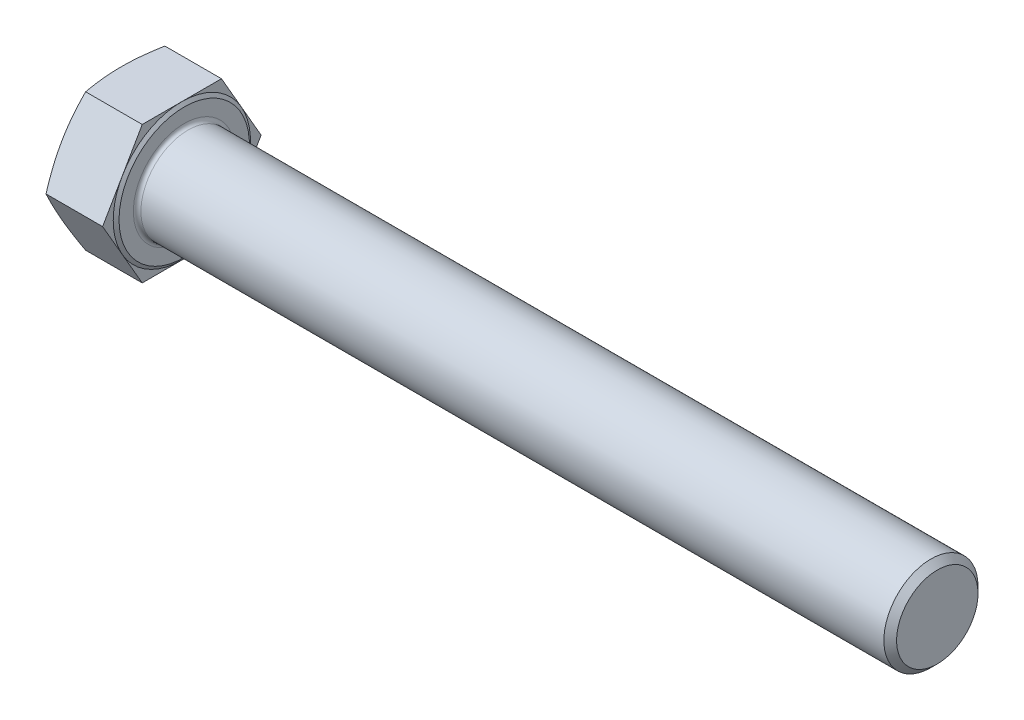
ISO-10303-21;
HEADER;
FILE_DESCRIPTION(('STEP AP214'),'2;1');
FILE_NAME('part.step','',(''),(''),'','','');
FILE_SCHEMA(('AUTOMOTIVE_DESIGN { 1 0 10303 214 1 1 1 1 }'));
ENDSEC;
DATA;
#1=APPLICATION_CONTEXT('core data for automotive mechanical design processes');
#2=APPLICATION_PROTOCOL_DEFINITION('international standard','automotive_design',2000,#1);
#3=PRODUCT_CONTEXT('',#1,'mechanical');
#4=PRODUCT('Part','Part','',(#3));
#5=PRODUCT_RELATED_PRODUCT_CATEGORY('part','',(#4));
#6=PRODUCT_DEFINITION_FORMATION('','',#4);
#7=PRODUCT_DEFINITION_CONTEXT('part definition',#1,'design');
#8=PRODUCT_DEFINITION('design','',#6,#7);
#9=PRODUCT_DEFINITION_SHAPE('','',#8);
#10=(LENGTH_UNIT() NAMED_UNIT(*) SI_UNIT(.MILLI.,.METRE.));
#11=(NAMED_UNIT(*) PLANE_ANGLE_UNIT() SI_UNIT($,.RADIAN.));
#12=(NAMED_UNIT(*) SI_UNIT($,.STERADIAN.) SOLID_ANGLE_UNIT());
#13=UNCERTAINTY_MEASURE_WITH_UNIT(LENGTH_MEASURE(1.E-05),#10,'distance_accuracy_value','');
#14=(GEOMETRIC_REPRESENTATION_CONTEXT(3) GLOBAL_UNCERTAINTY_ASSIGNED_CONTEXT((#13)) GLOBAL_UNIT_ASSIGNED_CONTEXT((#10,
#11,#12)) REPRESENTATION_CONTEXT('',''));
#15=CARTESIAN_POINT('',(0.,0.,0.));
#16=DIRECTION('',(0.,0.,1.));
#17=DIRECTION('',(1.,0.,0.));
#18=AXIS2_PLACEMENT_3D('',#15,#16,#17);
#19=CARTESIAN_POINT('',(13.35,0.,0.));
#20=DIRECTION('',(1.,0.,0.));
#21=DIRECTION('',(0.,0.,-1.));
#22=AXIS2_PLACEMENT_3D('',#19,#20,#21);
#23=PLANE('',#22);
#24=CARTESIAN_POINT('',(13.35,0.,0.));
#25=DIRECTION('',(1.,0.,0.));
#26=DIRECTION('',(0.,0.,-1.));
#27=AXIS2_PLACEMENT_3D('',#24,#25,#26);
#28=CIRCLE('',#27,10.8);
#29=CARTESIAN_POINT('',(13.35,0.,-10.8));
#30=VERTEX_POINT('',#29);
#31=EDGE_CURVE('E188',#30,#30,#28,.F.);
#32=ORIENTED_EDGE('',*,*,#31,.T.);
#33=EDGE_LOOP('',(#32));
#34=FACE_BOUND('',#33,.T.);
#35=CARTESIAN_POINT('',(13.35,0.,0.));
#36=DIRECTION('',(-1.,0.,0.));
#37=DIRECTION('',(0.,0.,1.));
#38=AXIS2_PLACEMENT_3D('',#35,#36,#37);
#39=CIRCLE('',#38,13.85);
#40=CARTESIAN_POINT('',(13.35,0.,13.85));
#41=VERTEX_POINT('',#40);
#42=EDGE_CURVE('E139',#41,#41,#39,.T.);
#43=ORIENTED_EDGE('',*,*,#42,.F.);
#44=EDGE_LOOP('',(#43));
#45=FACE_BOUND('',#44,.T.);
#46=ADVANCED_FACE('F33',(#34,#45),#23,.T.);
#47=CARTESIAN_POINT('',(12.85,0.,-16.8355338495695));
#48=DIRECTION('',(1.,0.,0.));
#49=DIRECTION('',(0.,0.,-1.));
#50=AXIS2_PLACEMENT_3D('',#47,#48,#49);
#51=PLANE('',#50);
#52=DIRECTION('',(0.,-0.866025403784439,0.5));
#53=VECTOR('',#52,1.);
#54=CARTESIAN_POINT('',(12.85,14.58,8.41776692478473));
#55=LINE('',#54,#53);
#56=CARTESIAN_POINT('',(12.85,14.58,8.41776692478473));
#57=VERTEX_POINT('',#56);
#58=CARTESIAN_POINT('',(12.85,7.29,12.6266503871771));
#59=VERTEX_POINT('',#58);
#60=EDGE_CURVE('E138',#57,#59,#55,.T.);
#61=ORIENTED_EDGE('',*,*,#60,.T.);
#62=CARTESIAN_POINT('',(12.85,0.,0.));
#63=DIRECTION('',(-1.,0.,0.));
#64=DIRECTION('',(0.,0.,1.));
#65=AXIS2_PLACEMENT_3D('',#62,#63,#64);
#66=CIRCLE('',#65,14.58);
#67=CARTESIAN_POINT('',(12.85,14.58,0.));
#68=VERTEX_POINT('',#67);
#69=EDGE_CURVE('E49',#59,#68,#66,.T.);
#70=ORIENTED_EDGE('',*,*,#69,.T.);
#71=DIRECTION('',(0.,0.,1.));
#72=VECTOR('',#71,1.);
#73=CARTESIAN_POINT('',(12.85,14.58,-8.41776692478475));
#74=LINE('',#73,#72);
#75=EDGE_CURVE('E135',#68,#57,#74,.T.);
#76=ORIENTED_EDGE('',*,*,#75,.T.);
#77=EDGE_LOOP('',(#61,#70,#76));
#78=FACE_BOUND('',#77,.T.);
#79=ADVANCED_FACE('F134',(#78),#51,.T.);
#80=CARTESIAN_POINT('',(12.85,14.58,-8.41776692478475));
#81=VERTEX_POINT('',#80);
#82=EDGE_CURVE('E145',#81,#68,#74,.T.);
#83=ORIENTED_EDGE('',*,*,#82,.T.);
#84=CARTESIAN_POINT('',(12.85,7.29,-12.6266503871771));
#85=VERTEX_POINT('',#84);
#86=EDGE_CURVE('E122',#68,#85,#66,.T.);
#87=ORIENTED_EDGE('',*,*,#86,.T.);
#88=DIRECTION('',(0.,0.866025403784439,0.5));
#89=VECTOR('',#88,1.);
#90=CARTESIAN_POINT('',(12.85,0.,-16.8355338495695));
#91=LINE('',#90,#89);
#92=EDGE_CURVE('E151',#85,#81,#91,.T.);
#93=ORIENTED_EDGE('',*,*,#92,.T.);
#94=EDGE_LOOP('',(#83,#87,#93));
#95=FACE_BOUND('',#94,.T.);
#96=ADVANCED_FACE('F150',(#95),#51,.T.);
#97=CARTESIAN_POINT('',(12.85,0.,-16.8355338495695));
#98=VERTEX_POINT('',#97);
#99=EDGE_CURVE('E148',#98,#85,#91,.T.);
#100=ORIENTED_EDGE('',*,*,#99,.T.);
#101=CARTESIAN_POINT('',(12.85,-7.29,-12.6266503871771));
#102=VERTEX_POINT('',#101);
#103=EDGE_CURVE('E125',#85,#102,#66,.T.);
#104=ORIENTED_EDGE('',*,*,#103,.T.);
#105=DIRECTION('',(0.,0.866025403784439,-0.5));
#106=VECTOR('',#105,1.);
#107=CARTESIAN_POINT('',(12.85,-14.58,-8.41776692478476));
#108=LINE('',#107,#106);
#109=EDGE_CURVE('E306',#102,#98,#108,.T.);
#110=ORIENTED_EDGE('',*,*,#109,.T.);
#111=EDGE_LOOP('',(#100,#104,#110));
#112=FACE_BOUND('',#111,.T.);
#113=ADVANCED_FACE('F337',(#112),#51,.T.);
#114=CARTESIAN_POINT('',(12.85,-14.58,-8.41776692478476));
#115=VERTEX_POINT('',#114);
#116=EDGE_CURVE('E304',#115,#102,#108,.T.);
#117=ORIENTED_EDGE('',*,*,#116,.T.);
#118=CARTESIAN_POINT('',(12.85,-14.58,0.));
#119=VERTEX_POINT('',#118);
#120=EDGE_CURVE('E338',#102,#119,#66,.T.);
#121=ORIENTED_EDGE('',*,*,#120,.T.);
#122=DIRECTION('',(0.,0.,-1.));
#123=VECTOR('',#122,1.);
#124=CARTESIAN_POINT('',(12.85,-14.58,8.41776692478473));
#125=LINE('',#124,#123);
#126=EDGE_CURVE('E162',#119,#115,#125,.T.);
#127=ORIENTED_EDGE('',*,*,#126,.T.);
#128=EDGE_LOOP('',(#117,#121,#127));
#129=FACE_BOUND('',#128,.T.);
#130=ADVANCED_FACE('F352',(#129),#51,.T.);
#131=CARTESIAN_POINT('',(12.85,-14.58,8.41776692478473));
#132=VERTEX_POINT('',#131);
#133=EDGE_CURVE('E163',#132,#119,#125,.T.);
#134=ORIENTED_EDGE('',*,*,#133,.T.);
#135=CARTESIAN_POINT('',(12.85,-7.29,12.6266503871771));
#136=VERTEX_POINT('',#135);
#137=EDGE_CURVE('E339',#119,#136,#66,.T.);
#138=ORIENTED_EDGE('',*,*,#137,.T.);
#139=DIRECTION('',(0.,-0.866025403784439,-0.5));
#140=VECTOR('',#139,1.);
#141=CARTESIAN_POINT('',(12.85,0.,16.8355338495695));
#142=LINE('',#141,#140);
#143=EDGE_CURVE('E158',#136,#132,#142,.T.);
#144=ORIENTED_EDGE('',*,*,#143,.T.);
#145=EDGE_LOOP('',(#134,#138,#144));
#146=FACE_BOUND('',#145,.T.);
#147=ADVANCED_FACE('F347',(#146),#51,.T.);
#148=CARTESIAN_POINT('',(12.85,0.,16.8355338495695));
#149=VERTEX_POINT('',#148);
#150=EDGE_CURVE('E159',#149,#136,#142,.T.);
#151=ORIENTED_EDGE('',*,*,#150,.T.);
#152=EDGE_CURVE('E140',#136,#59,#66,.T.);
#153=ORIENTED_EDGE('',*,*,#152,.T.);
#154=EDGE_CURVE('E153',#59,#149,#55,.T.);
#155=ORIENTED_EDGE('',*,*,#154,.T.);
#156=EDGE_LOOP('',(#151,#153,#155));
#157=FACE_BOUND('',#156,.T.);
#158=ADVANCED_FACE('F213',(#157),#51,.T.);
#159=CARTESIAN_POINT('',(12.85,-14.58,-8.41776692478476));
#160=DIRECTION('',(0.,0.5,0.866025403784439));
#161=DIRECTION('',(0.,-0.866025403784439,0.5));
#162=AXIS2_PLACEMENT_3D('',#159,#160,#161);
#163=PLANE('',#162);
#164=CARTESIAN_POINT('',(0.820989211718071,0.00020000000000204,-16.8356493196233));
#165=CARTESIAN_POINT('',(0.757543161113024,-0.301745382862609,-16.6613210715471));
#166=CARTESIAN_POINT('',(0.696950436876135,-0.604134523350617,-16.4867366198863));
#167=CARTESIAN_POINT('',(0.582099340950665,-1.20984152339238,-16.1370315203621));
#168=CARTESIAN_POINT('',(0.52784157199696,-1.51315946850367,-15.9619108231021));
#169=CARTESIAN_POINT('',(0.375459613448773,-2.42490202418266,-15.4355160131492));
#170=CARTESIAN_POINT('',(0.28781624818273,-3.03469793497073,-15.083450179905));
#171=CARTESIAN_POINT('',(0.181301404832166,-3.94862655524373,-14.5557932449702));
#172=CARTESIAN_POINT('',(0.150045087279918,-4.251704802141,-14.3808109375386));
#173=CARTESIAN_POINT('',(0.0960677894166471,-4.8584271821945,-14.0305196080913));
#174=CARTESIAN_POINT('',(0.0733464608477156,-5.16207129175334,-13.8552105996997));
#175=CARTESIAN_POINT('',(0.036836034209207,-5.76965850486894,-13.5044199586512));
#176=CARTESIAN_POINT('',(0.023043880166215,-6.07360147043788,-13.3289384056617));
#177=CARTESIAN_POINT('',(0.00462587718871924,-6.68169629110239,-12.9778546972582));
#178=CARTESIAN_POINT('',(0.,-6.98584814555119,-12.8022525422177));
#179=CARTESIAN_POINT('',(0.,-7.5941518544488,-12.4510482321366));
#180=CARTESIAN_POINT('',(0.00462587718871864,-7.89830370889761,-12.2754460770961));
#181=CARTESIAN_POINT('',(0.023043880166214,-8.50639852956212,-11.9243623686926));
#182=CARTESIAN_POINT('',(0.0368360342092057,-8.81034149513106,-11.7488808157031));
#183=CARTESIAN_POINT('',(0.0733464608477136,-9.41792870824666,-11.3980901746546));
#184=CARTESIAN_POINT('',(0.0960677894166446,-9.72157281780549,-11.222781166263));
#185=CARTESIAN_POINT('',(0.150045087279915,-10.328295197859,-10.8724898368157));
#186=CARTESIAN_POINT('',(0.181301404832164,-10.6313734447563,-10.697507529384));
#187=CARTESIAN_POINT('',(0.287816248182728,-11.5453020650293,-10.1698505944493));
#188=CARTESIAN_POINT('',(0.37545961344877,-12.1550979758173,-9.81778476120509));
#189=CARTESIAN_POINT('',(0.527841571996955,-13.0668405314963,-9.29138995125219));
#190=CARTESIAN_POINT('',(0.58209934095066,-13.3701584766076,-9.11626925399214));
#191=CARTESIAN_POINT('',(0.69695043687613,-13.9758654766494,-8.76656415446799));
#192=CARTESIAN_POINT('',(0.757543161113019,-14.2782546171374,-8.59197970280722));
#193=CARTESIAN_POINT('',(0.820989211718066,-14.5802,-8.41765145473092));
#194=B_SPLINE_CURVE_WITH_KNOTS('',3,(#164,#165,#166,#167,#168,#169,#170,#171,#172,#173,#174,
#175,#176,#177,#178,#179,#180,#181,#182,#183,#184,#185,#186,#187,#188,#189,#190,#191,#192,#193),
.UNSPECIFIED.,.F.,.F.,(4,2,2,2,2,2,2,2,2,2,2,2,2,2,4),(0.,1.063115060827,2.12633118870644,
4.25423325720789,5.30822304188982,6.36216981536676,7.4157556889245,8.46933831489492,
9.52292094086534,10.5765068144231,11.6304535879,12.6844433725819,14.8123454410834,
15.8755615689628,16.9386766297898),.UNSPECIFIED.);
#195=CARTESIAN_POINT('',(0.820947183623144,0.,-16.8355338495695));
#196=VERTEX_POINT('',#195);
#197=CARTESIAN_POINT('',(0.,-7.29,-12.6266503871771));
#198=VERTEX_POINT('',#197);
#199=EDGE_CURVE('E321',#196,#198,#194,.T.);
#200=ORIENTED_EDGE('',*,*,#199,.F.);
#201=DIRECTION('',(-1.,0.,0.));
#202=VECTOR('',#201,1.);
#203=CARTESIAN_POINT('',(12.85,0.,-16.8355338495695));
#204=LINE('',#203,#202);
#205=EDGE_CURVE('E178',#98,#196,#204,.T.);
#206=ORIENTED_EDGE('',*,*,#205,.F.);
#207=ORIENTED_EDGE('',*,*,#109,.F.);
#208=ORIENTED_EDGE('',*,*,#116,.F.);
#209=DIRECTION('',(-1.,0.,0.));
#210=VECTOR('',#209,1.);
#211=CARTESIAN_POINT('',(12.85,-14.58,-8.41776692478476));
#212=LINE('',#211,#210);
#213=CARTESIAN_POINT('',(0.820947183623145,-14.58,-8.41776692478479));
#214=VERTEX_POINT('',#213);
#215=EDGE_CURVE('E166',#115,#214,#212,.T.);
#216=ORIENTED_EDGE('',*,*,#215,.T.);
#217=EDGE_CURVE('E246',#198,#214,#194,.T.);
#218=ORIENTED_EDGE('',*,*,#217,.F.);
#219=EDGE_LOOP('',(#200,#206,#207,#208,#216,#218));
#220=FACE_BOUND('',#219,.T.);
#221=ADVANCED_FACE('F35',(#220),#163,.F.);
#222=CARTESIAN_POINT('',(12.85,0.,-16.8355338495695));
#223=DIRECTION('',(0.,-0.5,0.866025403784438));
#224=DIRECTION('',(0.,-0.866025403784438,-0.5));
#225=AXIS2_PLACEMENT_3D('',#222,#223,#224);
#226=PLANE('',#225);
#227=CARTESIAN_POINT('',(0.820989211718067,14.5802,-8.41765145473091));
#228=CARTESIAN_POINT('',(0.75754316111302,14.2782546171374,-8.59197970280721));
#229=CARTESIAN_POINT('',(0.696950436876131,13.9758654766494,-8.76656415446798));
#230=CARTESIAN_POINT('',(0.582099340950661,13.3701584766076,-9.11626925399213));
#231=CARTESIAN_POINT('',(0.527841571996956,13.0668405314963,-9.29138995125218));
#232=CARTESIAN_POINT('',(0.375459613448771,12.1550979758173,-9.81778476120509));
#233=CARTESIAN_POINT('',(0.287816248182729,11.5453020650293,-10.1698505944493));
#234=CARTESIAN_POINT('',(0.181301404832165,10.6313734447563,-10.697507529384));
#235=CARTESIAN_POINT('',(0.150045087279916,10.328295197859,-10.8724898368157));
#236=CARTESIAN_POINT('',(0.0960677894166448,9.7215728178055,-11.2227811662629));
#237=CARTESIAN_POINT('',(0.0733464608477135,9.41792870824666,-11.3980901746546));
#238=CARTESIAN_POINT('',(0.0368360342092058,8.81034149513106,-11.7488808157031));
#239=CARTESIAN_POINT('',(0.0230438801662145,8.50639852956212,-11.9243623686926));
#240=CARTESIAN_POINT('',(0.00462587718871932,7.89830370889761,-12.275446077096));
#241=CARTESIAN_POINT('',(0.,7.59415185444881,-12.4510482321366));
#242=CARTESIAN_POINT('',(0.,6.9858481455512,-12.8022525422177));
#243=CARTESIAN_POINT('',(0.00462587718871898,6.6816962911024,-12.9778546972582));
#244=CARTESIAN_POINT('',(0.0230438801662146,6.07360147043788,-13.3289384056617));
#245=CARTESIAN_POINT('',(0.0368360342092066,5.76965850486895,-13.5044199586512));
#246=CARTESIAN_POINT('',(0.073346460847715,5.16207129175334,-13.8552105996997));
#247=CARTESIAN_POINT('',(0.0960677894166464,4.8584271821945,-14.0305196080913));
#248=CARTESIAN_POINT('',(0.150045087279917,4.25170480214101,-14.3808109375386));
#249=CARTESIAN_POINT('',(0.181301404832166,3.94862655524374,-14.5557932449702));
#250=CARTESIAN_POINT('',(0.28781624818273,3.03469793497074,-15.0834501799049));
#251=CARTESIAN_POINT('',(0.375459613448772,2.42490202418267,-15.4355160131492));
#252=CARTESIAN_POINT('',(0.527841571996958,1.51315946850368,-15.9619108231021));
#253=CARTESIAN_POINT('',(0.582099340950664,1.20984152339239,-16.1370315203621));
#254=CARTESIAN_POINT('',(0.696950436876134,0.604134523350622,-16.4867366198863));
#255=CARTESIAN_POINT('',(0.757543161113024,0.301745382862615,-16.6613210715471));
#256=CARTESIAN_POINT('',(0.82098921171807,-0.000199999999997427,-16.8356493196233));
#257=B_SPLINE_CURVE_WITH_KNOTS('',3,(#227,#228,#229,#230,#231,#232,#233,#234,#235,#236,#237,
#238,#239,#240,#241,#242,#243,#244,#245,#246,#247,#248,#249,#250,#251,#252,#253,#254,#255,#256),
.UNSPECIFIED.,.F.,.F.,(4,2,2,2,2,2,2,2,2,2,2,2,2,2,4),(0.,1.063115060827,2.12633118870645,
4.25423325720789,5.30822304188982,6.36216981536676,7.4157556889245,8.46933831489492,
9.52292094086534,10.5765068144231,11.6304535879,12.6844433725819,14.8123454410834,
15.8755615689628,16.9386766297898),.UNSPECIFIED.);
#258=CARTESIAN_POINT('',(0.820947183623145,14.58,-8.41776692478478));
#259=VERTEX_POINT('',#258);
#260=CARTESIAN_POINT('',(0.,7.29,-12.6266503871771));
#261=VERTEX_POINT('',#260);
#262=EDGE_CURVE('E261',#259,#261,#257,.T.);
#263=ORIENTED_EDGE('',*,*,#262,.F.);
#264=DIRECTION('',(-1.,0.,0.));
#265=VECTOR('',#264,1.);
#266=CARTESIAN_POINT('',(12.85,14.58,-8.41776692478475));
#267=LINE('',#266,#265);
#268=EDGE_CURVE('E176',#81,#259,#267,.T.);
#269=ORIENTED_EDGE('',*,*,#268,.F.);
#270=ORIENTED_EDGE('',*,*,#92,.F.);
#271=ORIENTED_EDGE('',*,*,#99,.F.);
#272=ORIENTED_EDGE('',*,*,#205,.T.);
#273=EDGE_CURVE('E257',#261,#196,#257,.T.);
#274=ORIENTED_EDGE('',*,*,#273,.F.);
#275=EDGE_LOOP('',(#263,#269,#270,#271,#272,#274));
#276=FACE_BOUND('',#275,.T.);
#277=ADVANCED_FACE('F267',(#276),#226,.F.);
#278=CARTESIAN_POINT('',(12.85,14.58,-8.41776692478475));
#279=DIRECTION('',(0.,-1.,0.));
#280=DIRECTION('',(0.,0.,-1.));
#281=AXIS2_PLACEMENT_3D('',#278,#279,#280);
#282=PLANE('',#281);
#283=CARTESIAN_POINT('',(4.38681617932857,14.58,-22.2872869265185));
#284=CARTESIAN_POINT('',(4.28635974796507,14.58,-21.9574658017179));
#285=CARTESIAN_POINT('',(4.18651082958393,14.58,-21.6274597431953));
#286=CARTESIAN_POINT('',(3.9881640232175,14.58,-20.9670398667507));
#287=CARTESIAN_POINT('',(3.88966614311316,14.58,-20.6366260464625));
#288=CARTESIAN_POINT('',(3.59639036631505,14.58,-19.6446729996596));
#289=CARTESIAN_POINT('',(3.40384522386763,14.58,-18.9824709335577));
#290=CARTESIAN_POINT('',(3.02572803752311,14.58,-17.6547380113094));
#291=CARTESIAN_POINT('',(2.8401696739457,14.58,-16.9892032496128));
#292=CARTESIAN_POINT('',(2.47818253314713,14.58,-15.6556583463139));
#293=CARTESIAN_POINT('',(2.30175359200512,14.58,-14.9876482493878));
#294=CARTESIAN_POINT('',(1.9623964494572,14.58,-13.6569617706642));
#295=CARTESIAN_POINT('',(1.79932861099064,14.58,-12.9943211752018));
#296=CARTESIAN_POINT('',(1.48707598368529,14.58,-11.6657426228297));
#297=CARTESIAN_POINT('',(1.33789142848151,14.58,-10.9998046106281));
#298=CARTESIAN_POINT('',(1.05688376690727,14.58,-9.66448218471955));
#299=CARTESIAN_POINT('',(0.925054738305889,14.58,-8.99509902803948));
#300=CARTESIAN_POINT('',(0.682772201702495,14.58,-7.65244648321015));
#301=CARTESIAN_POINT('',(0.572317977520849,14.58,-6.97917722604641));
#302=CARTESIAN_POINT('',(0.388208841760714,14.58,-5.70456524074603));
#303=CARTESIAN_POINT('',(0.311816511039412,14.58,-5.10362163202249));
#304=CARTESIAN_POINT('',(0.182502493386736,14.58,-3.89919332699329));
#305=CARTESIAN_POINT('',(0.129580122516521,14.58,-3.2957087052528));
#306=CARTESIAN_POINT('',(0.0497546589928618,14.58,-2.08742246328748));
#307=CARTESIAN_POINT('',(0.0228331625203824,14.58,-1.48262207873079));
#308=CARTESIAN_POINT('',(-0.00362752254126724,14.58,-0.272416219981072));
#309=CARTESIAN_POINT('',(-0.00316690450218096,14.58,0.332989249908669));
#310=CARTESIAN_POINT('',(0.025183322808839,14.58,1.54621894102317));
#311=CARTESIAN_POINT('',(0.053212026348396,14.58,2.15403985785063));
#312=CARTESIAN_POINT('',(0.135408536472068,14.58,3.36789636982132));
#313=CARTESIAN_POINT('',(0.18957697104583,14.58,3.97393192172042));
#314=CARTESIAN_POINT('',(0.321518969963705,14.58,5.18391845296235));
#315=CARTESIAN_POINT('',(0.399312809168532,14.58,5.78786718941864));
#316=CARTESIAN_POINT('',(0.575350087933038,14.58,6.99274325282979));
#317=CARTESIAN_POINT('',(0.673593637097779,14.58,7.59367056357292));
#318=CARTESIAN_POINT('',(0.892986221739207,14.58,8.82412567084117));
#319=CARTESIAN_POINT('',(1.01507197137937,14.58,9.45348496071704));
#320=CARTESIAN_POINT('',(1.27495663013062,14.58,10.7089716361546));
#321=CARTESIAN_POINT('',(1.41275672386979,14.58,11.3350987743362));
#322=CARTESIAN_POINT('',(1.70117655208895,14.58,12.5845673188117));
#323=CARTESIAN_POINT('',(1.85180000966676,14.58,13.2079078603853));
#324=CARTESIAN_POINT('',(2.16341636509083,14.58,14.4519630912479));
#325=CARTESIAN_POINT('',(2.32440901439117,14.58,15.0726778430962));
#326=CARTESIAN_POINT('',(2.65503767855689,14.58,16.3126467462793));
#327=CARTESIAN_POINT('',(2.82468452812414,14.58,16.9318979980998));
#328=CARTESIAN_POINT('',(3.1708793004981,14.58,18.1684658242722));
#329=CARTESIAN_POINT('',(3.34742725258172,14.58,18.7857823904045));
#330=CARTESIAN_POINT('',(3.70616102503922,14.58,20.0186592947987));
#331=CARTESIAN_POINT('',(3.88834589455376,14.58,20.6342199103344));
#332=CARTESIAN_POINT('',(4.25740259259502,14.58,21.86393068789));
#333=CARTESIAN_POINT('',(4.44427441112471,14.58,22.4780808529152));
#334=CARTESIAN_POINT('',(4.81983822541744,14.58,23.6984029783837));
#335=CARTESIAN_POINT('',(5.00848733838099,14.58,24.3045881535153));
#336=CARTESIAN_POINT('',(5.38900290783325,14.58,25.5159485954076));
#337=CARTESIAN_POINT('',(5.5808693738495,14.58,26.1211238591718));
#338=CARTESIAN_POINT('',(6.1605499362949,14.58,27.9354030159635));
#339=CARTESIAN_POINT('',(6.55242903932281,14.58,29.1432080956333));
#340=CARTESIAN_POINT('',(7.34258830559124,14.58,31.5516392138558));
#341=CARTESIAN_POINT('',(7.74083853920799,14.58,32.7522751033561));
#342=CARTESIAN_POINT('',(8.34263566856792,14.58,34.551693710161));
#343=CARTESIAN_POINT('',(8.54396347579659,14.58,35.1512199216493));
#344=CARTESIAN_POINT('',(8.9479218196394,14.58,36.3498317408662));
#345=CARTESIAN_POINT('',(9.15055235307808,14.58,36.9489173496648));
#346=CARTESIAN_POINT('',(9.35374656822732,14.58,37.547811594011));
#347=B_SPLINE_CURVE_WITH_KNOTS('',3,(#283,#284,#285,#286,#287,#288,#289,#290,#291,#292,#293,
#294,#295,#296,#297,#298,#299,#300,#301,#302,#303,#304,#305,#306,#307,#308,#309,#310,#311,#312,
#313,#314,#315,#316,#317,#318,#319,#320,#321,#322,#323,#324,#325,#326,#327,#328,#329,#330,#331,
#332,#333,#334,#335,#336,#337,#338,#339,#340,#341,#342,#343,#344,#345,#346),.UNSPECIFIED.,.F.,
.F.,(4,2,2,2,2,2,2,2,2,2,2,2,2,2,2,2,2,2,2,2,2,2,2,2,2,2,2,2,2,2,2,4),(0.,1.03433986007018,
2.06868575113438,4.1375304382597,6.21023507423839,8.28290248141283,10.3300149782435,
12.3771619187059,14.4236084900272,16.4699864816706,18.2869265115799,20.1038135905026,
21.9194137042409,23.7350009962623,25.5597960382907,27.3846349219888,29.2110442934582,
31.037463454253,32.960491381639,34.8836643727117,36.8073976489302,38.7310848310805,
40.657242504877,42.5834083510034,44.5092510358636,46.4350896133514,48.3396631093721,
50.2442422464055,54.0535643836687,57.8484326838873,59.7457139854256,61.6429906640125),.UNSPECIFIED.);
#348=CARTESIAN_POINT('',(0.820947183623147,14.5800000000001,8.41776692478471));
#349=VERTEX_POINT('',#348);
#350=CARTESIAN_POINT('',(0.,14.58,0.));
#351=VERTEX_POINT('',#350);
#352=EDGE_CURVE('E57',#349,#351,#347,.F.);
#353=ORIENTED_EDGE('',*,*,#352,.F.);
#354=DIRECTION('',(-1.,0.,0.));
#355=VECTOR('',#354,1.);
#356=CARTESIAN_POINT('',(12.85,14.58,8.41776692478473));
#357=LINE('',#356,#355);
#358=EDGE_CURVE('E147',#57,#349,#357,.T.);
#359=ORIENTED_EDGE('',*,*,#358,.F.);
#360=ORIENTED_EDGE('',*,*,#75,.F.);
#361=ORIENTED_EDGE('',*,*,#82,.F.);
#362=ORIENTED_EDGE('',*,*,#268,.T.);
#363=EDGE_CURVE('E262',#351,#259,#347,.F.);
#364=ORIENTED_EDGE('',*,*,#363,.F.);
#365=EDGE_LOOP('',(#353,#359,#360,#361,#362,#364));
#366=FACE_BOUND('',#365,.T.);
#367=ADVANCED_FACE('F143',(#366),#282,.F.);
#368=CARTESIAN_POINT('',(12.85,14.58,8.41776692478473));
#369=DIRECTION('',(0.,-0.5,-0.866025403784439));
#370=DIRECTION('',(0.,0.866025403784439,-0.5));
#371=AXIS2_PLACEMENT_3D('',#368,#369,#370);
#372=PLANE('',#371);
#373=CARTESIAN_POINT('',(0.820989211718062,-0.000199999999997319,16.8356493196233));
#374=CARTESIAN_POINT('',(0.757543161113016,0.301745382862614,16.661321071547));
#375=CARTESIAN_POINT('',(0.696950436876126,0.604134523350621,16.4867366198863));
#376=CARTESIAN_POINT('',(0.582099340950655,1.20984152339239,16.1370315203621));
#377=CARTESIAN_POINT('',(0.52784157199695,1.51315946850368,15.9619108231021));
#378=CARTESIAN_POINT('',(0.375459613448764,2.42490202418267,15.4355160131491));
#379=CARTESIAN_POINT('',(0.287816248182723,3.03469793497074,15.0834501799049));
#380=CARTESIAN_POINT('',(0.18130140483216,3.94862655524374,14.5557932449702));
#381=CARTESIAN_POINT('',(0.150045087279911,4.251704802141,14.3808109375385));
#382=CARTESIAN_POINT('',(0.0960677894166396,4.8584271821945,14.0305196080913));
#383=CARTESIAN_POINT('',(0.0733464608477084,5.16207129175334,13.8552105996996));
#384=CARTESIAN_POINT('',(0.0368360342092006,5.76965850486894,13.5044199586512));
#385=CARTESIAN_POINT('',(0.0230438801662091,6.07360147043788,13.3289384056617));
#386=CARTESIAN_POINT('',(0.0046258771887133,6.68169629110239,12.9778546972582));
#387=CARTESIAN_POINT('',(0.,6.9858481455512,12.8022525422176));
#388=CARTESIAN_POINT('',(0.,7.59415185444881,12.4510482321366));
#389=CARTESIAN_POINT('',(0.00462587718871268,7.89830370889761,12.275446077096));
#390=CARTESIAN_POINT('',(0.0230438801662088,8.50639852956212,11.9243623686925));
#391=CARTESIAN_POINT('',(0.036836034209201,8.81034149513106,11.748880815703));
#392=CARTESIAN_POINT('',(0.0733464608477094,9.41792870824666,11.3980901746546));
#393=CARTESIAN_POINT('',(0.0960677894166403,9.7215728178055,11.2227811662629));
#394=CARTESIAN_POINT('',(0.150045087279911,10.328295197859,10.8724898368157));
#395=CARTESIAN_POINT('',(0.181301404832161,10.6313734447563,10.697507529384));
#396=CARTESIAN_POINT('',(0.287816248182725,11.5453020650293,10.1698505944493));
#397=CARTESIAN_POINT('',(0.375459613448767,12.1550979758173,9.81778476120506));
#398=CARTESIAN_POINT('',(0.527841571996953,13.0668405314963,9.29138995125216));
#399=CARTESIAN_POINT('',(0.582099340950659,13.3701584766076,9.11626925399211));
#400=CARTESIAN_POINT('',(0.696950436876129,13.9758654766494,8.76656415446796));
#401=CARTESIAN_POINT('',(0.757543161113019,14.2782546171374,8.59197970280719));
#402=CARTESIAN_POINT('',(0.820989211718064,14.5802,8.4176514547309));
#403=B_SPLINE_CURVE_WITH_KNOTS('',3,(#373,#374,#375,#376,#377,#378,#379,#380,#381,#382,#383,
#384,#385,#386,#387,#388,#389,#390,#391,#392,#393,#394,#395,#396,#397,#398,#399,#400,#401,#402),
.UNSPECIFIED.,.F.,.F.,(4,2,2,2,2,2,2,2,2,2,2,2,2,2,4),(0.,1.063115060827,2.12633118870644,
4.25423325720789,5.30822304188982,6.36216981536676,7.4157556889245,8.46933831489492,
9.52292094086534,10.5765068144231,11.6304535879,12.6844433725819,14.8123454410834,
15.8755615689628,16.9386766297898),.UNSPECIFIED.);
#404=CARTESIAN_POINT('',(0.820947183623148,0.,16.8355338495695));
#405=VERTEX_POINT('',#404);
#406=CARTESIAN_POINT('',(0.,7.29,12.6266503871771));
#407=VERTEX_POINT('',#406);
#408=EDGE_CURVE('E251',#405,#407,#403,.T.);
#409=ORIENTED_EDGE('',*,*,#408,.F.);
#410=DIRECTION('',(-1.,0.,0.));
#411=VECTOR('',#410,1.);
#412=CARTESIAN_POINT('',(12.85,0.,16.8355338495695));
#413=LINE('',#412,#411);
#414=EDGE_CURVE('E172',#149,#405,#413,.T.);
#415=ORIENTED_EDGE('',*,*,#414,.F.);
#416=ORIENTED_EDGE('',*,*,#154,.F.);
#417=ORIENTED_EDGE('',*,*,#60,.F.);
#418=ORIENTED_EDGE('',*,*,#358,.T.);
#419=EDGE_CURVE('E312',#407,#349,#403,.T.);
#420=ORIENTED_EDGE('',*,*,#419,.F.);
#421=EDGE_LOOP('',(#409,#415,#416,#417,#418,#420));
#422=FACE_BOUND('',#421,.T.);
#423=ADVANCED_FACE('F273',(#422),#372,.F.);
#424=CARTESIAN_POINT('',(12.85,0.,16.8355338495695));
#425=DIRECTION('',(0.,0.5,-0.866025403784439));
#426=DIRECTION('',(0.,0.866025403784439,0.5));
#427=AXIS2_PLACEMENT_3D('',#424,#425,#426);
#428=PLANE('',#427);
#429=CARTESIAN_POINT('',(0.820989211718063,-14.5802,8.41765145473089));
#430=CARTESIAN_POINT('',(0.757543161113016,-14.2782546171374,8.59197970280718));
#431=CARTESIAN_POINT('',(0.696950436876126,-13.9758654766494,8.76656415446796));
#432=CARTESIAN_POINT('',(0.582099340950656,-13.3701584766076,9.11626925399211));
#433=CARTESIAN_POINT('',(0.527841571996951,-13.0668405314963,9.29138995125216));
#434=CARTESIAN_POINT('',(0.375459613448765,-12.1550979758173,9.81778476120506));
#435=CARTESIAN_POINT('',(0.287816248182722,-11.5453020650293,10.1698505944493));
#436=CARTESIAN_POINT('',(0.181301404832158,-10.6313734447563,10.697507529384));
#437=CARTESIAN_POINT('',(0.150045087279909,-10.328295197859,10.8724898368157));
#438=CARTESIAN_POINT('',(0.0960677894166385,-9.7215728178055,11.2227811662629));
#439=CARTESIAN_POINT('',(0.0733464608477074,-9.41792870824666,11.3980901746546));
#440=CARTESIAN_POINT('',(0.0368360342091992,-8.81034149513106,11.748880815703));
#441=CARTESIAN_POINT('',(0.0230438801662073,-8.50639852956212,11.9243623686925));
#442=CARTESIAN_POINT('',(0.0046258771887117,-7.89830370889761,12.275446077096));
#443=CARTESIAN_POINT('',(0.,-7.5941518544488,12.4510482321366));
#444=CARTESIAN_POINT('',(0.,-6.98584814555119,12.8022525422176));
#445=CARTESIAN_POINT('',(0.00462587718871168,-6.68169629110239,12.9778546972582));
#446=CARTESIAN_POINT('',(0.0230438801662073,-6.07360147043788,13.3289384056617));
#447=CARTESIAN_POINT('',(0.0368360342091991,-5.76965850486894,13.5044199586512));
#448=CARTESIAN_POINT('',(0.0733464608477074,-5.16207129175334,13.8552105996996));
#449=CARTESIAN_POINT('',(0.0960677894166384,-4.8584271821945,14.0305196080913));
#450=CARTESIAN_POINT('',(0.150045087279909,-4.251704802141,14.3808109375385));
#451=CARTESIAN_POINT('',(0.181301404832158,-3.94862655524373,14.5557932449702));
#452=CARTESIAN_POINT('',(0.287816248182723,-3.03469793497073,15.0834501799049));
#453=CARTESIAN_POINT('',(0.375459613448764,-2.42490202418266,15.4355160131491));
#454=CARTESIAN_POINT('',(0.52784157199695,-1.51315946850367,15.9619108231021));
#455=CARTESIAN_POINT('',(0.582099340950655,-1.20984152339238,16.1370315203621));
#456=CARTESIAN_POINT('',(0.696950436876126,-0.604134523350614,16.4867366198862));
#457=CARTESIAN_POINT('',(0.757543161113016,-0.301745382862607,16.661321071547));
#458=CARTESIAN_POINT('',(0.820989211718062,0.000200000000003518,16.8356493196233));
#459=B_SPLINE_CURVE_WITH_KNOTS('',3,(#429,#430,#431,#432,#433,#434,#435,#436,#437,#438,#439,
#440,#441,#442,#443,#444,#445,#446,#447,#448,#449,#450,#451,#452,#453,#454,#455,#456,#457,#458),
.UNSPECIFIED.,.F.,.F.,(4,2,2,2,2,2,2,2,2,2,2,2,2,2,4),(0.,1.063115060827,2.12633118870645,
4.25423325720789,5.30822304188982,6.36216981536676,7.41575568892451,8.46933831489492,
9.52292094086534,10.5765068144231,11.6304535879,12.684443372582,14.8123454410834,
15.8755615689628,16.9386766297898),.UNSPECIFIED.);
#460=CARTESIAN_POINT('',(0.820947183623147,-14.58,8.41776692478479));
#461=VERTEX_POINT('',#460);
#462=CARTESIAN_POINT('',(0.,-7.29000000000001,12.6266503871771));
#463=VERTEX_POINT('',#462);
#464=EDGE_CURVE('E239',#461,#463,#459,.T.);
#465=ORIENTED_EDGE('',*,*,#464,.F.);
#466=DIRECTION('',(-1.,0.,0.));
#467=VECTOR('',#466,1.);
#468=CARTESIAN_POINT('',(12.85,-14.58,8.41776692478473));
#469=LINE('',#468,#467);
#470=EDGE_CURVE('E169',#132,#461,#469,.T.);
#471=ORIENTED_EDGE('',*,*,#470,.F.);
#472=ORIENTED_EDGE('',*,*,#143,.F.);
#473=ORIENTED_EDGE('',*,*,#150,.F.);
#474=ORIENTED_EDGE('',*,*,#414,.T.);
#475=EDGE_CURVE('E317',#463,#405,#459,.T.);
#476=ORIENTED_EDGE('',*,*,#475,.F.);
#477=EDGE_LOOP('',(#465,#471,#472,#473,#474,#476));
#478=FACE_BOUND('',#477,.T.);
#479=ADVANCED_FACE('F276',(#478),#428,.F.);
#480=CARTESIAN_POINT('',(12.85,-14.58,8.41776692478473));
#481=DIRECTION('',(0.,1.,0.));
#482=DIRECTION('',(0.,0.,1.));
#483=AXIS2_PLACEMENT_3D('',#480,#481,#482);
#484=PLANE('',#483);
#485=CARTESIAN_POINT('',(4.38681617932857,-14.58,-22.2872869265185));
#486=CARTESIAN_POINT('',(4.28635974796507,-14.58,-21.9574658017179));
#487=CARTESIAN_POINT('',(4.18651082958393,-14.58,-21.6274597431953));
#488=CARTESIAN_POINT('',(3.9881640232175,-14.58,-20.9670398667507));
#489=CARTESIAN_POINT('',(3.88966614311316,-14.58,-20.6366260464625));
#490=CARTESIAN_POINT('',(3.59639036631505,-14.58,-19.6446729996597));
#491=CARTESIAN_POINT('',(3.40384522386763,-14.58,-18.9824709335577));
#492=CARTESIAN_POINT('',(3.02572803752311,-14.58,-17.6547380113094));
#493=CARTESIAN_POINT('',(2.8401696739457,-14.58,-16.9892032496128));
#494=CARTESIAN_POINT('',(2.47818253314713,-14.58,-15.6556583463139));
#495=CARTESIAN_POINT('',(2.30175359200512,-14.58,-14.9876482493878));
#496=CARTESIAN_POINT('',(1.96239644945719,-14.58,-13.6569617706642));
#497=CARTESIAN_POINT('',(1.79932861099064,-14.58,-12.9943211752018));
#498=CARTESIAN_POINT('',(1.48707598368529,-14.58,-11.6657426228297));
#499=CARTESIAN_POINT('',(1.33789142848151,-14.58,-10.9998046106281));
#500=CARTESIAN_POINT('',(1.05688376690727,-14.58,-9.66448218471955));
#501=CARTESIAN_POINT('',(0.925054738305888,-14.58,-8.99509902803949));
#502=CARTESIAN_POINT('',(0.682772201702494,-14.58,-7.65244648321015));
#503=CARTESIAN_POINT('',(0.572317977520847,-14.58,-6.97917722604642));
#504=CARTESIAN_POINT('',(0.388208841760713,-14.58,-5.70456524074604));
#505=CARTESIAN_POINT('',(0.311816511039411,-14.58,-5.1036216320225));
#506=CARTESIAN_POINT('',(0.182502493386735,-14.58,-3.8991933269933));
#507=CARTESIAN_POINT('',(0.12958012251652,-14.58,-3.29570870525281));
#508=CARTESIAN_POINT('',(0.0497546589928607,-14.58,-2.08742246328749));
#509=CARTESIAN_POINT('',(0.0228331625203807,-14.58,-1.4826220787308));
#510=CARTESIAN_POINT('',(-0.00362752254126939,-14.58,-0.272416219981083));
#511=CARTESIAN_POINT('',(-0.00316690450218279,-14.58,0.332989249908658));
#512=CARTESIAN_POINT('',(0.0251833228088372,-14.58,1.54621894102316));
#513=CARTESIAN_POINT('',(0.0532120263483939,-14.58,2.15403985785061));
#514=CARTESIAN_POINT('',(0.135408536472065,-14.58,3.36789636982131));
#515=CARTESIAN_POINT('',(0.189576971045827,-14.58,3.9739319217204));
#516=CARTESIAN_POINT('',(0.321518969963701,-14.58,5.18391845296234));
#517=CARTESIAN_POINT('',(0.399312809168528,-14.58,5.78786718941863));
#518=CARTESIAN_POINT('',(0.575350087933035,-14.58,6.99274325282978));
#519=CARTESIAN_POINT('',(0.673593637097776,-14.58,7.59367056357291));
#520=CARTESIAN_POINT('',(0.892986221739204,-14.58,8.82412567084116));
#521=CARTESIAN_POINT('',(1.01507197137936,-14.58,9.45348496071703));
#522=CARTESIAN_POINT('',(1.27495663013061,-14.58,10.7089716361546));
#523=CARTESIAN_POINT('',(1.41275672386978,-14.58,11.3350987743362));
#524=CARTESIAN_POINT('',(1.70117655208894,-14.58,12.5845673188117));
#525=CARTESIAN_POINT('',(1.85180000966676,-14.58,13.2079078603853));
#526=CARTESIAN_POINT('',(2.16341636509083,-14.58,14.4519630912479));
#527=CARTESIAN_POINT('',(2.32440901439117,-14.58,15.0726778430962));
#528=CARTESIAN_POINT('',(2.65503767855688,-14.58,16.3126467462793));
#529=CARTESIAN_POINT('',(2.82468452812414,-14.58,16.9318979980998));
#530=CARTESIAN_POINT('',(3.1708793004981,-14.58,18.1684658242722));
#531=CARTESIAN_POINT('',(3.34742725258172,-14.58,18.7857823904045));
#532=CARTESIAN_POINT('',(3.70616102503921,-14.58,20.0186592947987));
#533=CARTESIAN_POINT('',(3.88834589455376,-14.58,20.6342199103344));
#534=CARTESIAN_POINT('',(4.25740259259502,-14.58,21.86393068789));
#535=CARTESIAN_POINT('',(4.44427441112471,-14.58,22.4780808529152));
#536=CARTESIAN_POINT('',(4.81983822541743,-14.58,23.6984029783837));
#537=CARTESIAN_POINT('',(5.00848733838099,-14.58,24.3045881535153));
#538=CARTESIAN_POINT('',(5.38900290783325,-14.58,25.5159485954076));
#539=CARTESIAN_POINT('',(5.5808693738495,-14.58,26.1211238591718));
#540=CARTESIAN_POINT('',(6.1605499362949,-14.58,27.9354030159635));
#541=CARTESIAN_POINT('',(6.55242903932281,-14.58,29.1432080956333));
#542=CARTESIAN_POINT('',(7.34258830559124,-14.58,31.5516392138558));
#543=CARTESIAN_POINT('',(7.74083853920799,-14.58,32.7522751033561));
#544=CARTESIAN_POINT('',(8.34263566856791,-14.58,34.551693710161));
#545=CARTESIAN_POINT('',(8.54396347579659,-14.58,35.1512199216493));
#546=CARTESIAN_POINT('',(8.9479218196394,-14.58,36.3498317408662));
#547=CARTESIAN_POINT('',(9.15055235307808,-14.58,36.9489173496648));
#548=CARTESIAN_POINT('',(9.35374656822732,-14.58,37.547811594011));
#549=B_SPLINE_CURVE_WITH_KNOTS('',3,(#485,#486,#487,#488,#489,#490,#491,#492,#493,#494,#495,
#496,#497,#498,#499,#500,#501,#502,#503,#504,#505,#506,#507,#508,#509,#510,#511,#512,#513,#514,
#515,#516,#517,#518,#519,#520,#521,#522,#523,#524,#525,#526,#527,#528,#529,#530,#531,#532,#533,
#534,#535,#536,#537,#538,#539,#540,#541,#542,#543,#544,#545,#546,#547,#548),.UNSPECIFIED.,.F.,
.F.,(4,2,2,2,2,2,2,2,2,2,2,2,2,2,2,2,2,2,2,2,2,2,2,2,2,2,2,2,2,2,2,4),(0.,1.03433986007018,
2.06868575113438,4.1375304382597,6.21023507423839,8.28290248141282,10.3300149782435,
12.3771619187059,14.4236084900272,16.4699864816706,18.2869265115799,20.1038135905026,
21.9194137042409,23.7350009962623,25.5597960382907,27.3846349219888,29.2110442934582,
31.037463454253,32.960491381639,34.8836643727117,36.8073976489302,38.7310848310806,
40.657242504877,42.5834083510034,44.5092510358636,46.4350896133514,48.3396631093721,
50.2442422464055,54.0535643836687,57.8484326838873,59.7457139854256,61.6429906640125),.UNSPECIFIED.);
#550=CARTESIAN_POINT('',(0.,-14.58,0.));
#551=VERTEX_POINT('',#550);
#552=EDGE_CURVE('E295',#214,#551,#549,.T.);
#553=ORIENTED_EDGE('',*,*,#552,.F.);
#554=ORIENTED_EDGE('',*,*,#215,.F.);
#555=ORIENTED_EDGE('',*,*,#126,.F.);
#556=ORIENTED_EDGE('',*,*,#133,.F.);
#557=ORIENTED_EDGE('',*,*,#470,.T.);
#558=EDGE_CURVE('E229',#551,#461,#549,.T.);
#559=ORIENTED_EDGE('',*,*,#558,.F.);
#560=EDGE_LOOP('',(#553,#554,#555,#556,#557,#559));
#561=FACE_BOUND('',#560,.T.);
#562=ADVANCED_FACE('F280',(#561),#484,.F.);
#563=CARTESIAN_POINT('',(0.,0.,0.));
#564=DIRECTION('',(1.,0.,0.));
#565=DIRECTION('',(0.,0.,-1.));
#566=AXIS2_PLACEMENT_3D('',#563,#564,#565);
#567=CONICAL_SURFACE('',#566,14.58,1.22173047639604);
#568=ORIENTED_EDGE('',*,*,#273,.T.);
#569=ORIENTED_EDGE('',*,*,#199,.T.);
#570=CARTESIAN_POINT('',(0.,0.,0.));
#571=DIRECTION('',(1.,0.,0.));
#572=DIRECTION('',(0.,0.,-1.));
#573=AXIS2_PLACEMENT_3D('',#570,#571,#572);
#574=CIRCLE('',#573,14.58);
#575=EDGE_CURVE('E181',#198,#261,#574,.T.);
#576=ORIENTED_EDGE('',*,*,#575,.T.);
#577=EDGE_LOOP('',(#568,#569,#576));
#578=FACE_BOUND('',#577,.T.);
#579=ADVANCED_FACE('F284',(#578),#567,.T.);
#580=ORIENTED_EDGE('',*,*,#217,.T.);
#581=ORIENTED_EDGE('',*,*,#552,.T.);
#582=EDGE_CURVE('E184',#551,#198,#574,.T.);
#583=ORIENTED_EDGE('',*,*,#582,.T.);
#584=EDGE_LOOP('',(#580,#581,#583));
#585=FACE_BOUND('',#584,.T.);
#586=ADVANCED_FACE('F289',(#585),#567,.T.);
#587=ORIENTED_EDGE('',*,*,#464,.T.);
#588=EDGE_CURVE('E330',#463,#551,#574,.T.);
#589=ORIENTED_EDGE('',*,*,#588,.T.);
#590=ORIENTED_EDGE('',*,*,#558,.T.);
#591=EDGE_LOOP('',(#587,#589,#590));
#592=FACE_BOUND('',#591,.T.);
#593=ADVANCED_FACE('F224',(#592),#567,.T.);
#594=ORIENTED_EDGE('',*,*,#408,.T.);
#595=EDGE_CURVE('E336',#407,#463,#574,.T.);
#596=ORIENTED_EDGE('',*,*,#595,.T.);
#597=ORIENTED_EDGE('',*,*,#475,.T.);
#598=EDGE_LOOP('',(#594,#596,#597));
#599=FACE_BOUND('',#598,.T.);
#600=ADVANCED_FACE('F223',(#599),#567,.T.);
#601=ORIENTED_EDGE('',*,*,#352,.T.);
#602=CARTESIAN_POINT('',(0.,0.,0.));
#603=DIRECTION('',(-1.,0.,0.));
#604=DIRECTION('',(0.,0.,1.));
#605=AXIS2_PLACEMENT_3D('',#602,#603,#604);
#606=CIRCLE('',#605,14.58);
#607=EDGE_CURVE('E335',#407,#351,#606,.T.);
#608=ORIENTED_EDGE('',*,*,#607,.F.);
#609=ORIENTED_EDGE('',*,*,#419,.T.);
#610=EDGE_LOOP('',(#601,#608,#609));
#611=FACE_BOUND('',#610,.T.);
#612=ADVANCED_FACE('F218',(#611),#567,.T.);
#613=ORIENTED_EDGE('',*,*,#363,.T.);
#614=ORIENTED_EDGE('',*,*,#262,.T.);
#615=EDGE_CURVE('E185',#261,#351,#574,.T.);
#616=ORIENTED_EDGE('',*,*,#615,.T.);
#617=EDGE_LOOP('',(#613,#614,#616));
#618=FACE_BOUND('',#617,.T.);
#619=ADVANCED_FACE('F222',(#618),#567,.T.);
#620=CARTESIAN_POINT('',(0.,0.,-16.8355338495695));
#621=DIRECTION('',(1.,0.,0.));
#622=DIRECTION('',(0.,0.,-1.));
#623=AXIS2_PLACEMENT_3D('',#620,#621,#622);
#624=PLANE('',#623);
#625=ORIENTED_EDGE('',*,*,#615,.F.);
#626=ORIENTED_EDGE('',*,*,#575,.F.);
#627=ORIENTED_EDGE('',*,*,#582,.F.);
#628=ORIENTED_EDGE('',*,*,#588,.F.);
#629=ORIENTED_EDGE('',*,*,#595,.F.);
#630=ORIENTED_EDGE('',*,*,#607,.T.);
#631=EDGE_LOOP('',(#625,#626,#627,#628,#629,#630));
#632=FACE_BOUND('',#631,.T.);
#633=ADVANCED_FACE('F225',(#632),#624,.F.);
#634=CARTESIAN_POINT('',(12.85,0.,0.));
#635=DIRECTION('',(-1.,0.,0.));
#636=DIRECTION('',(0.,0.,1.));
#637=AXIS2_PLACEMENT_3D('',#634,#635,#636);
#638=CONICAL_SURFACE('',#637,14.58,0.970255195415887);
#639=ORIENTED_EDGE('',*,*,#42,.T.);
#640=EDGE_LOOP('',(#639));
#641=FACE_BOUND('',#640,.T.);
#642=ORIENTED_EDGE('',*,*,#69,.F.);
#643=ORIENTED_EDGE('',*,*,#152,.F.);
#644=ORIENTED_EDGE('',*,*,#137,.F.);
#645=ORIENTED_EDGE('',*,*,#120,.F.);
#646=ORIENTED_EDGE('',*,*,#103,.F.);
#647=ORIENTED_EDGE('',*,*,#86,.F.);
#648=EDGE_LOOP('',(#642,#643,#644,#645,#646,#647));
#649=FACE_BOUND('',#648,.T.);
#650=ADVANCED_FACE('F123',(#641,#649),#638,.T.);
#651=CARTESIAN_POINT('',(173.35,0.,0.));
#652=DIRECTION('',(-1.,0.,0.));
#653=DIRECTION('',(0.,0.,1.));
#654=AXIS2_PLACEMENT_3D('',#651,#652,#653);
#655=CYLINDRICAL_SURFACE('',#654,10.);
#656=CARTESIAN_POINT('',(171.997,0.,0.));
#657=DIRECTION('',(1.,0.,0.));
#658=DIRECTION('',(0.,0.,-1.));
#659=AXIS2_PLACEMENT_3D('',#656,#657,#658);
#660=CIRCLE('',#659,10.);
#661=CARTESIAN_POINT('',(171.997,0.,-10.));
#662=VERTEX_POINT('',#661);
#663=EDGE_CURVE('E11',#662,#662,#660,.F.);
#664=ORIENTED_EDGE('',*,*,#663,.T.);
#665=EDGE_LOOP('',(#664));
#666=FACE_BOUND('',#665,.T.);
#667=CARTESIAN_POINT('',(14.15,0.,0.));
#668=DIRECTION('',(1.,0.,0.));
#669=DIRECTION('',(0.,0.,-1.));
#670=AXIS2_PLACEMENT_3D('',#667,#668,#669);
#671=CIRCLE('',#670,10.);
#672=CARTESIAN_POINT('',(14.15,0.,-10.));
#673=VERTEX_POINT('',#672);
#674=EDGE_CURVE('E129',#673,#673,#671,.T.);
#675=ORIENTED_EDGE('',*,*,#674,.T.);
#676=EDGE_LOOP('',(#675));
#677=FACE_BOUND('',#676,.T.);
#678=ADVANCED_FACE('F454',(#666,#677),#655,.T.);
#679=CARTESIAN_POINT('',(173.35,0.,0.));
#680=DIRECTION('',(1.,0.,0.));
#681=DIRECTION('',(0.,0.,-1.));
#682=AXIS2_PLACEMENT_3D('',#679,#680,#681);
#683=PLANE('',#682);
#684=CARTESIAN_POINT('',(173.35,0.,0.));
#685=DIRECTION('',(1.,0.,0.));
#686=DIRECTION('',(0.,0.,-1.));
#687=AXIS2_PLACEMENT_3D('',#684,#685,#686);
#688=CIRCLE('',#687,8.64699999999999);
#689=CARTESIAN_POINT('',(173.35,0.,-8.64700000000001));
#690=VERTEX_POINT('',#689);
#691=EDGE_CURVE('E42',#690,#690,#688,.T.);
#692=ORIENTED_EDGE('',*,*,#691,.T.);
#693=EDGE_LOOP('',(#692));
#694=FACE_BOUND('',#693,.T.);
#695=ADVANCED_FACE('F193',(#694),#683,.T.);
#696=CARTESIAN_POINT('',(14.15,0.,0.));
#697=DIRECTION('',(1.,0.,0.));
#698=DIRECTION('',(0.,0.,-1.));
#699=AXIS2_PLACEMENT_3D('',#696,#697,#698);
#700=TOROIDAL_SURFACE('',#699,10.8,0.8);
#701=ORIENTED_EDGE('',*,*,#31,.F.);
#702=EDGE_LOOP('',(#701));
#703=FACE_BOUND('',#702,.T.);
#704=ORIENTED_EDGE('',*,*,#674,.F.);
#705=EDGE_LOOP('',(#704));
#706=FACE_BOUND('',#705,.T.);
#707=ADVANCED_FACE('F197',(#703,#706),#700,.F.);
#708=CARTESIAN_POINT('',(173.35,0.,0.));
#709=DIRECTION('',(-1.,0.,0.));
#710=DIRECTION('',(0.,0.,1.));
#711=AXIS2_PLACEMENT_3D('',#708,#709,#710);
#712=CONICAL_SURFACE('',#711,8.64699999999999,0.785398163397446);
#713=ORIENTED_EDGE('',*,*,#663,.F.);
#714=EDGE_LOOP('',(#713));
#715=FACE_BOUND('',#714,.T.);
#716=ORIENTED_EDGE('',*,*,#691,.F.);
#717=EDGE_LOOP('',(#716));
#718=FACE_BOUND('',#717,.T.);
#719=ADVANCED_FACE('F195',(#715,#718),#712,.T.);
#720=CLOSED_SHELL('',(#46,#79,#96,#113,#130,#147,#158,#221,#277,#367,#423,#479,#562,#579,#586,
#593,#600,#612,#619,#633,#650,#678,#695,#707,#719));
#721=MANIFOLD_SOLID_BREP('B2',#720);
#722=ADVANCED_BREP_SHAPE_REPRESENTATION('',(#18,#721),#14);
#723=SHAPE_DEFINITION_REPRESENTATION(#9,#722);
ENDSEC;
END-ISO-10303-21;
